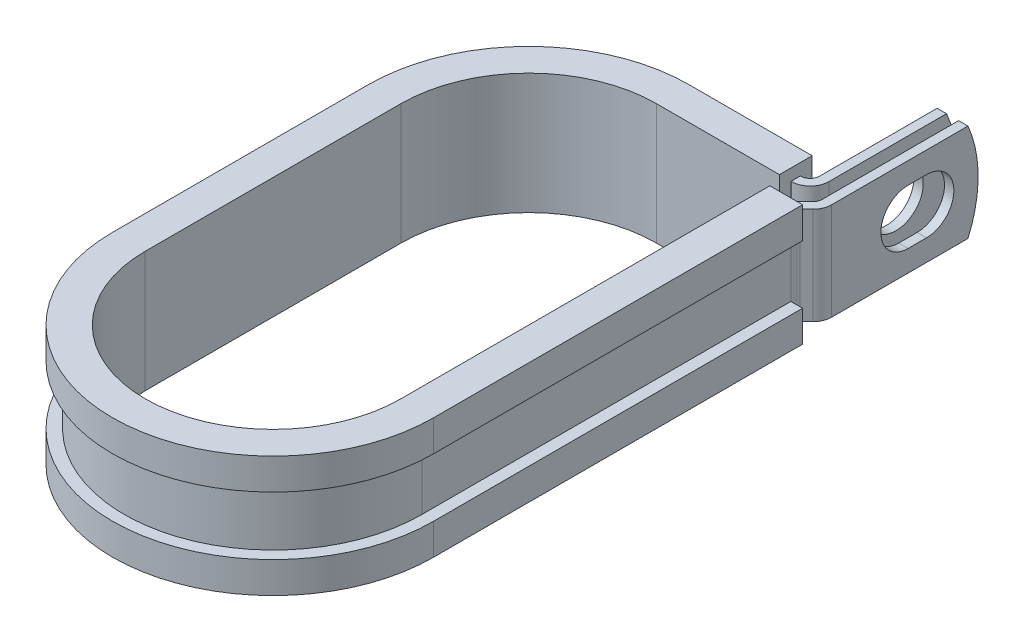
from build123d import *

# Parameters (mm, degrees)
EXTRUDE_THIN1_DEPTH = 6.35
SKETCH2_R           = 3.5687
CUT_EXTRUDE1_DEPTH  = 1.2192
CUT_EXTRUDE2_DEPTH  = 1.2192
CUT_EXTRUDE3_DEPTH  = 65.555209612


with BuildPart() as part:
    # Sketch1 → Extrude-Thin1 (new, symmetric)
    with BuildSketch(Plane(origin=(0, 0, 0), x_dir=(1, 0, 0), z_dir=(0, 1, 0))):
        with BuildLine():
            Line((20.0838698, 37.2872), (20.0838698, 18.1864))
            ThreePointArc((20.0838698, 18.1864), (19.991063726, 17.719832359), (19.726774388, 17.324295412))
            Line((19.726774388, 17.324295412), (18.900590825, 16.498111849))
            ThreePointArc((18.900590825, 16.498111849), (18.372012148, 15.707037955), (18.1864, 14.773902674))
            Line((18.1864, 14.773902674), (18.1864, 0))
            Line((18.1864, 0), (18.1864, -33.3248))
            ThreePointArc((18.1864, -33.3248), (0, -51.5112), (-18.1864, -33.3248))
            Line((-18.1864, -33.3248), (-18.1864, 0))
            ThreePointArc((-18.1864, 0), (-12.859726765, 12.859726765), (0, 18.1864))
            Line((0, 18.1864), (16.0706698, 18.1864))
            ThreePointArc((16.0706698, 18.1864), (17.794878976, 18.900590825), (18.5090698, 20.6248))
            Line((18.5090698, 20.6248), (18.5090698, 37.2872))
            Line((18.5090698, 37.2872), (17.2898698, 37.2872))
            Line((17.2898698, 37.2872), (17.2898698, 20.6248))
            ThreePointArc((17.2898698, 20.6248), (16.932774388, 19.762695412), (16.0706698, 19.4056))
            Line((16.0706698, 19.4056), (0, 19.4056))
            ThreePointArc((0, 19.4056), (-13.721831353, 13.721831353), (-19.4056, 0))
            Line((-19.4056, 0), (-19.4056, -33.3248))
            ThreePointArc((-19.4056, -33.3248), (0, -52.7304), (19.4056, -33.3248))
            Line((19.4056, -33.3248), (19.4056, 0))
            Line((19.4056, 0), (19.4056, 14.773902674))
            ThreePointArc((19.4056, 14.773902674), (19.498406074, 15.240470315), (19.762695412, 15.636007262))
            Line((19.762695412, 15.636007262), (20.588878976, 16.462190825))
            ThreePointArc((20.588878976, 16.462190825), (21.117457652, 17.253264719), (21.3030698, 18.1864))
            Line((21.3030698, 18.1864), (21.3030698, 37.2872))
            Line((21.3030698, 37.2872), (20.0838698, 37.2872))
        make_face()
    extrude(amount=EXTRUDE_THIN1_DEPTH, both=True)

    # Sketch2 → Cut-Extrude1 (cut)
    with BuildSketch(Plane.ZY.offset(-17.2898698)):
        with Locations((-29.3624, 0)):
            Circle(SKETCH2_R)
    extrude(amount=-CUT_EXTRUDE1_DEPTH, mode=Mode.SUBTRACT)

    # Sketch3 → Cut-Extrude2 (cut)
    with BuildSketch(Plane(origin=(21.3030698, 0, 0), x_dir=(0, 0, -1), z_dir=(1, 0, 0))):
        with BuildLine():
            Line((28.1686, 3.5687), (30.5562, 3.5687))
            ThreePointArc((30.5562, 3.5687), (34.1249, 0), (30.5562, -3.5687))
            Line((30.5562, -3.5687), (28.1686, -3.5687))
            ThreePointArc((28.1686, -3.5687), (24.5999, 0), (28.1686, 3.5687))
        make_face()
    extrude(amount=-CUT_EXTRUDE2_DEPTH, mode=Mode.SUBTRACT)

    # Sketch4 → Cut-Extrude3 (cut, through all)
    with BuildSketch(Plane.ZY.offset(-17.2898698)):
        with BuildLine():
            Line((-35.961877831, 6.35), (-37.2872, 6.35))
            Line((-37.2872, 6.35), (-37.2872, -8.8e-08))
            ThreePointArc((-37.2872, -8.8e-08), (-36.952337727, 3.24341555), (-35.961877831, 6.35))
        make_face()
        with BuildLine():
            ThreePointArc((-35.961877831, -6.35), (-36.952337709, -3.243415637), (-37.2872, -8.8e-08))
            Line((-37.2872, -8.8e-08), (-37.2872, -6.35))
            Line((-37.2872, -6.35), (-35.961877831, -6.35))
        make_face()
    extrude(amount=-CUT_EXTRUDE3_DEPTH, mode=Mode.SUBTRACT)

    # Sweep1: sweep along a path in Sketch6
    with BuildLine(Plane(origin=(0, 6.35, 0), x_dir=(1, 0, 0), z_dir=(0, 1, 0))) as sweep1_path:
        Line((16.6624, 14.773902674), (16.6624, 0))
        Line((16.6624, 0), (16.6624, -33.3248))
        ThreePointArc((16.6624, -33.3248), (0, -49.9872), (-16.6624, -33.3248))
        Line((-16.6624, -33.3248), (-16.6624, 0))
        ThreePointArc((-16.6624, 0), (-11.782096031, 11.782096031), (0, 16.6624))
        Line((0, 16.6624), (16.0198698, 16.6624))
    # Sketch5 → Sweep1 (sweep)
    with BuildSketch(Plane(origin=(0, 0, -14.773902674), x_dir=(-1, 0, 0), z_dir=(0, 0, -1))):
        Polygon((-19.4056, 6.35), (-18.1864, 6.35), (-18.1864, -6.35), (-19.4056, -6.35), (-19.4056, -3.81), (-20.9296, -3.81), (-20.9296, -7.874), (-16.6624, -7.874), (-16.6624, 7.874), (-20.9296, 7.874), (-20.9296, 3.81), (-19.4056, 3.81), align=None)
    sweep(path=sweep1_path.line)


solid = part.part
